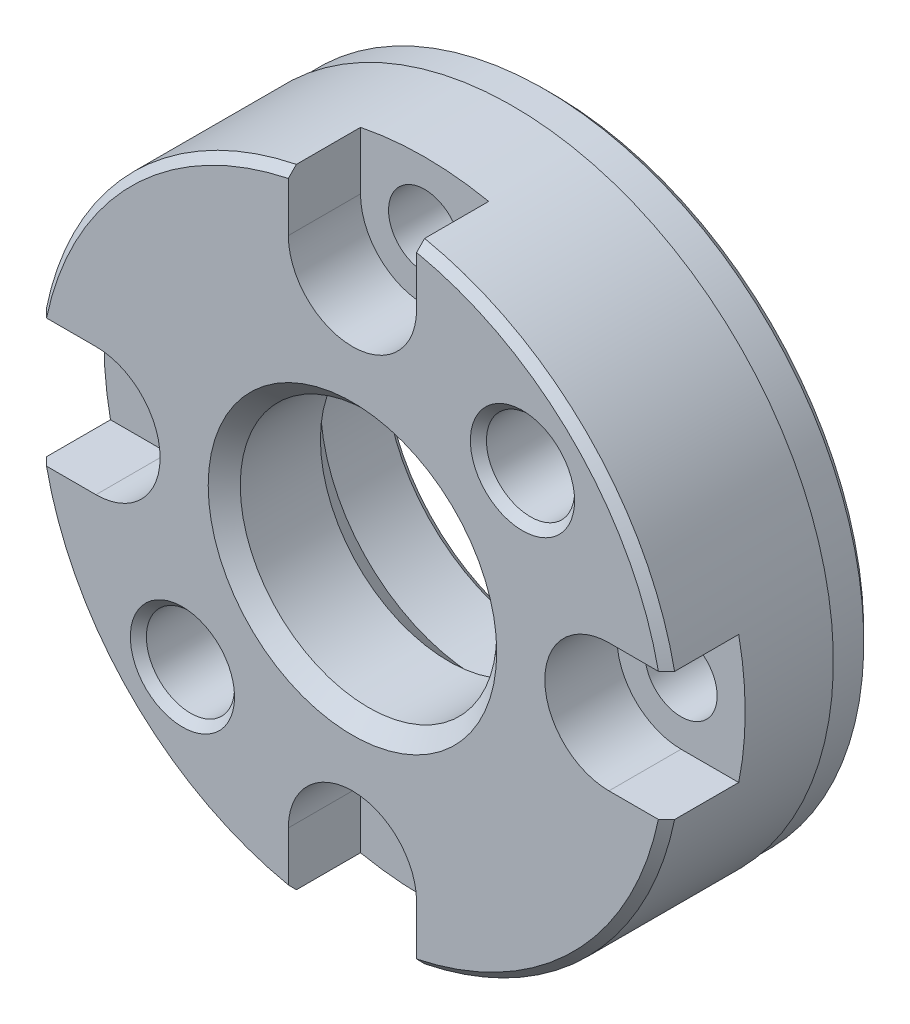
ISO-10303-21;
HEADER;
FILE_DESCRIPTION(('STEP AP214'),'2;1');
FILE_NAME('part.step','',(''),(''),'','','');
FILE_SCHEMA(('AUTOMOTIVE_DESIGN { 1 0 10303 214 1 1 1 1 }'));
ENDSEC;
DATA;
#1=APPLICATION_CONTEXT('core data for automotive mechanical design processes');
#2=APPLICATION_PROTOCOL_DEFINITION('international standard','automotive_design',2000,#1);
#3=PRODUCT_CONTEXT('',#1,'mechanical');
#4=PRODUCT('Part','Part','',(#3));
#5=PRODUCT_RELATED_PRODUCT_CATEGORY('part','',(#4));
#6=PRODUCT_DEFINITION_FORMATION('','',#4);
#7=PRODUCT_DEFINITION_CONTEXT('part definition',#1,'design');
#8=PRODUCT_DEFINITION('design','',#6,#7);
#9=PRODUCT_DEFINITION_SHAPE('','',#8);
#10=(LENGTH_UNIT() NAMED_UNIT(*) SI_UNIT(.MILLI.,.METRE.));
#11=(NAMED_UNIT(*) PLANE_ANGLE_UNIT() SI_UNIT($,.RADIAN.));
#12=(NAMED_UNIT(*) SI_UNIT($,.STERADIAN.) SOLID_ANGLE_UNIT());
#13=UNCERTAINTY_MEASURE_WITH_UNIT(LENGTH_MEASURE(1.E-05),#10,'distance_accuracy_value','');
#14=(GEOMETRIC_REPRESENTATION_CONTEXT(3) GLOBAL_UNCERTAINTY_ASSIGNED_CONTEXT((#13)) GLOBAL_UNIT_ASSIGNED_CONTEXT((#10,
#11,#12)) REPRESENTATION_CONTEXT('',''));
#15=CARTESIAN_POINT('',(0.,0.,0.));
#16=DIRECTION('',(0.,0.,1.));
#17=DIRECTION('',(1.,0.,0.));
#18=AXIS2_PLACEMENT_3D('',#15,#16,#17);
#19=CARTESIAN_POINT('',(-20.,0.,0.));
#20=DIRECTION('',(0.,0.,-1.));
#21=DIRECTION('',(-1.,0.,0.));
#22=AXIS2_PLACEMENT_3D('',#19,#20,#21);
#23=PLANE('',#22);
#24=CARTESIAN_POINT('',(10.6066017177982,10.6066017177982,0.));
#25=DIRECTION('',(0.,0.,1.));
#26=DIRECTION('',(1.,0.,0.));
#27=AXIS2_PLACEMENT_3D('',#24,#25,#26);
#28=CIRCLE('',#27,2.5);
#29=CARTESIAN_POINT('',(13.1066017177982,10.6066017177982,0.));
#30=VERTEX_POINT('',#29);
#31=EDGE_CURVE('E470',#30,#30,#28,.T.);
#32=ORIENTED_EDGE('',*,*,#31,.T.);
#33=EDGE_LOOP('',(#32));
#34=FACE_BOUND('',#33,.T.);
#35=CARTESIAN_POINT('',(-16.,0.,0.));
#36=DIRECTION('',(0.,0.,-1.));
#37=DIRECTION('',(-1.,0.,0.));
#38=AXIS2_PLACEMENT_3D('',#35,#36,#37);
#39=CIRCLE('',#38,2.75);
#40=CARTESIAN_POINT('',(-18.75,0.,0.));
#41=VERTEX_POINT('',#40);
#42=EDGE_CURVE('E277',#41,#41,#39,.F.);
#43=ORIENTED_EDGE('',*,*,#42,.T.);
#44=EDGE_LOOP('',(#43));
#45=FACE_BOUND('',#44,.T.);
#46=CARTESIAN_POINT('',(0.,-16.,0.));
#47=DIRECTION('',(0.,0.,-1.));
#48=DIRECTION('',(-1.,0.,0.));
#49=AXIS2_PLACEMENT_3D('',#46,#47,#48);
#50=CIRCLE('',#49,2.75);
#51=CARTESIAN_POINT('',(-2.74999999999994,-16.,0.));
#52=VERTEX_POINT('',#51);
#53=EDGE_CURVE('E290',#52,#52,#50,.F.);
#54=ORIENTED_EDGE('',*,*,#53,.T.);
#55=EDGE_LOOP('',(#54));
#56=FACE_BOUND('',#55,.T.);
#57=CARTESIAN_POINT('',(16.,1.13686837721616E-13,0.));
#58=DIRECTION('',(0.,0.,-1.));
#59=DIRECTION('',(-1.,0.,0.));
#60=AXIS2_PLACEMENT_3D('',#57,#58,#59);
#61=CIRCLE('',#60,2.75);
#62=CARTESIAN_POINT('',(13.25,1.13686837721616E-13,0.));
#63=VERTEX_POINT('',#62);
#64=EDGE_CURVE('E296',#63,#63,#61,.F.);
#65=ORIENTED_EDGE('',*,*,#64,.T.);
#66=EDGE_LOOP('',(#65));
#67=FACE_BOUND('',#66,.T.);
#68=CARTESIAN_POINT('',(-1.69550539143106E-13,16.,0.));
#69=DIRECTION('',(0.,0.,-1.));
#70=DIRECTION('',(-1.,0.,0.));
#71=AXIS2_PLACEMENT_3D('',#68,#69,#70);
#72=CIRCLE('',#71,2.75);
#73=CARTESIAN_POINT('',(-2.75000000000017,16.,0.));
#74=VERTEX_POINT('',#73);
#75=EDGE_CURVE('E302',#74,#74,#72,.F.);
#76=ORIENTED_EDGE('',*,*,#75,.T.);
#77=EDGE_LOOP('',(#76));
#78=FACE_BOUND('',#77,.T.);
#79=CARTESIAN_POINT('',(0.,0.,0.));
#80=DIRECTION('',(0.,0.,-1.));
#81=DIRECTION('',(-1.,0.,0.));
#82=AXIS2_PLACEMENT_3D('',#79,#80,#81);
#83=CIRCLE('',#82,19.4);
#84=CARTESIAN_POINT('',(-19.4,0.,0.));
#85=VERTEX_POINT('',#84);
#86=EDGE_CURVE('E358',#85,#85,#83,.T.);
#87=ORIENTED_EDGE('',*,*,#86,.T.);
#88=EDGE_LOOP('',(#87));
#89=FACE_BOUND('',#88,.T.);
#90=CARTESIAN_POINT('',(0.,0.,0.));
#91=DIRECTION('',(0.,0.,-1.));
#92=DIRECTION('',(-1.,0.,0.));
#93=AXIS2_PLACEMENT_3D('',#90,#91,#92);
#94=CIRCLE('',#93,10.5);
#95=CARTESIAN_POINT('',(-10.5,0.,0.));
#96=VERTEX_POINT('',#95);
#97=EDGE_CURVE('E458',#96,#96,#94,.F.);
#98=ORIENTED_EDGE('',*,*,#97,.T.);
#99=EDGE_LOOP('',(#98));
#100=FACE_BOUND('',#99,.T.);
#101=CARTESIAN_POINT('',(-10.6066017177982,-10.6066017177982,0.));
#102=DIRECTION('',(0.,0.,1.));
#103=DIRECTION('',(1.,0.,0.));
#104=AXIS2_PLACEMENT_3D('',#101,#102,#103);
#105=CIRCLE('',#104,2.5);
#106=CARTESIAN_POINT('',(-8.10660171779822,-10.6066017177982,0.));
#107=VERTEX_POINT('',#106);
#108=EDGE_CURVE('E461',#107,#107,#105,.T.);
#109=ORIENTED_EDGE('',*,*,#108,.T.);
#110=EDGE_LOOP('',(#109));
#111=FACE_BOUND('',#110,.T.);
#112=ADVANCED_FACE('F16',(#34,#45,#56,#67,#78,#89,#100,#111),#23,.T.);
#113=CARTESIAN_POINT('',(-20.,0.,12.5));
#114=DIRECTION('',(0.,0.,1.));
#115=DIRECTION('',(1.,0.,0.));
#116=AXIS2_PLACEMENT_3D('',#113,#114,#115);
#117=PLANE('',#116);
#118=CARTESIAN_POINT('',(-10.6066017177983,-10.6066017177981,12.5));
#119=DIRECTION('',(0.,0.,1.));
#120=DIRECTION('',(1.,0.,0.));
#121=AXIS2_PLACEMENT_3D('',#118,#119,#120);
#122=CIRCLE('',#121,3.25);
#123=CARTESIAN_POINT('',(-7.3566017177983,-10.6066017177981,12.5));
#124=VERTEX_POINT('',#123);
#125=EDGE_CURVE('E24',#124,#124,#122,.F.);
#126=ORIENTED_EDGE('',*,*,#125,.T.);
#127=EDGE_LOOP('',(#126));
#128=FACE_BOUND('',#127,.T.);
#129=CARTESIAN_POINT('',(10.6066017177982,10.6066017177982,12.5));
#130=DIRECTION('',(0.,0.,1.));
#131=DIRECTION('',(1.,0.,0.));
#132=AXIS2_PLACEMENT_3D('',#129,#130,#131);
#133=CIRCLE('',#132,3.25);
#134=CARTESIAN_POINT('',(13.8566017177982,10.6066017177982,12.5));
#135=VERTEX_POINT('',#134);
#136=EDGE_CURVE('E971',#135,#135,#133,.F.);
#137=ORIENTED_EDGE('',*,*,#136,.T.);
#138=EDGE_LOOP('',(#137));
#139=FACE_BOUND('',#138,.T.);
#140=CARTESIAN_POINT('',(0.,0.,12.5));
#141=DIRECTION('',(0.,0.,1.));
#142=DIRECTION('',(1.,0.,0.));
#143=AXIS2_PLACEMENT_3D('',#140,#141,#142);
#144=CIRCLE('',#143,9.);
#145=CARTESIAN_POINT('',(9.,0.,12.5));
#146=VERTEX_POINT('',#145);
#147=EDGE_CURVE('E984',#146,#146,#144,.F.);
#148=ORIENTED_EDGE('',*,*,#147,.T.);
#149=EDGE_LOOP('',(#148));
#150=FACE_BOUND('',#149,.T.);
#151=DIRECTION('',(1.,0.,0.));
#152=VECTOR('',#151,1.);
#153=CARTESIAN_POINT('',(-16.,-4.,12.5));
#154=LINE('',#153,#152);
#155=CARTESIAN_POINT('',(-19.0853346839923,-4.,12.5));
#156=VERTEX_POINT('',#155);
#157=CARTESIAN_POINT('',(-16.,-4.,12.5));
#158=VERTEX_POINT('',#157);
#159=EDGE_CURVE('E260',#156,#158,#154,.T.);
#160=ORIENTED_EDGE('',*,*,#159,.F.);
#161=CARTESIAN_POINT('',(0.,0.,12.5));
#162=DIRECTION('',(0.,0.,1.));
#163=DIRECTION('',(1.,0.,0.));
#164=AXIS2_PLACEMENT_3D('',#161,#162,#163);
#165=CIRCLE('',#164,19.5);
#166=CARTESIAN_POINT('',(-3.99999999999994,-19.0853346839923,12.5));
#167=VERTEX_POINT('',#166);
#168=EDGE_CURVE('E532',#156,#167,#165,.T.);
#169=ORIENTED_EDGE('',*,*,#168,.T.);
#170=DIRECTION('',(0.,-1.,0.));
#171=VECTOR('',#170,1.);
#172=CARTESIAN_POINT('',(-3.99999999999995,-16.,12.5));
#173=LINE('',#172,#171);
#174=CARTESIAN_POINT('',(-3.99999999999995,-16.,12.5));
#175=VERTEX_POINT('',#174);
#176=EDGE_CURVE('E238',#175,#167,#173,.T.);
#177=ORIENTED_EDGE('',*,*,#176,.F.);
#178=CARTESIAN_POINT('',(0.,-16.,12.5));
#179=DIRECTION('',(0.,0.,1.));
#180=DIRECTION('',(0.,1.,0.));
#181=AXIS2_PLACEMENT_3D('',#178,#179,#180);
#182=CIRCLE('',#181,4.);
#183=CARTESIAN_POINT('',(4.00000000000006,-16.,12.5));
#184=VERTEX_POINT('',#183);
#185=EDGE_CURVE('E217',#184,#175,#182,.T.);
#186=ORIENTED_EDGE('',*,*,#185,.F.);
#187=DIRECTION('',(0.,1.,0.));
#188=VECTOR('',#187,1.);
#189=CARTESIAN_POINT('',(4.00000000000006,-16.,12.5));
#190=LINE('',#189,#188);
#191=CARTESIAN_POINT('',(4.00000000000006,-19.0853346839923,12.5));
#192=VERTEX_POINT('',#191);
#193=EDGE_CURVE('E228',#192,#184,#190,.T.);
#194=ORIENTED_EDGE('',*,*,#193,.F.);
#195=CARTESIAN_POINT('',(0.,0.,12.5));
#196=DIRECTION('',(0.,0.,1.));
#197=DIRECTION('',(1.,0.,0.));
#198=AXIS2_PLACEMENT_3D('',#195,#196,#197);
#199=CIRCLE('',#198,19.5);
#200=CARTESIAN_POINT('',(19.0853346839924,-3.99999999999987,12.5));
#201=VERTEX_POINT('',#200);
#202=EDGE_CURVE('E526',#192,#201,#199,.T.);
#203=ORIENTED_EDGE('',*,*,#202,.T.);
#204=DIRECTION('',(1.,0.,0.));
#205=VECTOR('',#204,1.);
#206=CARTESIAN_POINT('',(16.,-3.99999999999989,12.5));
#207=LINE('',#206,#205);
#208=CARTESIAN_POINT('',(16.,-3.99999999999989,12.5));
#209=VERTEX_POINT('',#208);
#210=EDGE_CURVE('E210',#209,#201,#207,.T.);
#211=ORIENTED_EDGE('',*,*,#210,.F.);
#212=CARTESIAN_POINT('',(16.,1.13686837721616E-13,12.5));
#213=DIRECTION('',(0.,0.,1.));
#214=DIRECTION('',(-1.,0.,0.));
#215=AXIS2_PLACEMENT_3D('',#212,#213,#214);
#216=CIRCLE('',#215,4.);
#217=CARTESIAN_POINT('',(16.,4.00000000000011,12.5));
#218=VERTEX_POINT('',#217);
#219=EDGE_CURVE('E191',#218,#209,#216,.T.);
#220=ORIENTED_EDGE('',*,*,#219,.F.);
#221=DIRECTION('',(-1.,0.,0.));
#222=VECTOR('',#221,1.);
#223=CARTESIAN_POINT('',(16.,4.00000000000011,12.5));
#224=LINE('',#223,#222);
#225=CARTESIAN_POINT('',(19.0853346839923,4.00000000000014,12.5));
#226=VERTEX_POINT('',#225);
#227=EDGE_CURVE('E200',#226,#218,#224,.T.);
#228=ORIENTED_EDGE('',*,*,#227,.F.);
#229=CARTESIAN_POINT('',(0.,0.,12.5));
#230=DIRECTION('',(0.,0.,1.));
#231=DIRECTION('',(1.,0.,0.));
#232=AXIS2_PLACEMENT_3D('',#229,#230,#231);
#233=CIRCLE('',#232,19.5);
#234=CARTESIAN_POINT('',(3.9999999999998,19.0853346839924,12.5));
#235=VERTEX_POINT('',#234);
#236=EDGE_CURVE('E31',#226,#235,#233,.T.);
#237=ORIENTED_EDGE('',*,*,#236,.T.);
#238=DIRECTION('',(0.,1.,0.));
#239=VECTOR('',#238,1.);
#240=CARTESIAN_POINT('',(3.99999999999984,16.,12.5));
#241=LINE('',#240,#239);
#242=CARTESIAN_POINT('',(3.99999999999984,16.,12.5));
#243=VERTEX_POINT('',#242);
#244=EDGE_CURVE('E179',#243,#235,#241,.T.);
#245=ORIENTED_EDGE('',*,*,#244,.F.);
#246=CARTESIAN_POINT('',(-1.69550539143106E-13,16.,12.5));
#247=DIRECTION('',(0.,0.,1.));
#248=DIRECTION('',(0.,-1.,0.));
#249=AXIS2_PLACEMENT_3D('',#246,#247,#248);
#250=CIRCLE('',#249,4.);
#251=CARTESIAN_POINT('',(-4.00000000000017,16.,12.5));
#252=VERTEX_POINT('',#251);
#253=EDGE_CURVE('E162',#252,#243,#250,.T.);
#254=ORIENTED_EDGE('',*,*,#253,.F.);
#255=DIRECTION('',(0.,-1.,0.));
#256=VECTOR('',#255,1.);
#257=CARTESIAN_POINT('',(-4.00000000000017,16.,12.5));
#258=LINE('',#257,#256);
#259=CARTESIAN_POINT('',(-4.0000000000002,19.0853346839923,12.5));
#260=VERTEX_POINT('',#259);
#261=EDGE_CURVE('E177',#260,#252,#258,.T.);
#262=ORIENTED_EDGE('',*,*,#261,.F.);
#263=CARTESIAN_POINT('',(0.,0.,12.5));
#264=DIRECTION('',(0.,0.,1.));
#265=DIRECTION('',(1.,0.,0.));
#266=AXIS2_PLACEMENT_3D('',#263,#264,#265);
#267=CIRCLE('',#266,19.5);
#268=CARTESIAN_POINT('',(-19.0853346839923,4.,12.5));
#269=VERTEX_POINT('',#268);
#270=EDGE_CURVE('E328',#260,#269,#267,.T.);
#271=ORIENTED_EDGE('',*,*,#270,.T.);
#272=DIRECTION('',(-1.,0.,0.));
#273=VECTOR('',#272,1.);
#274=CARTESIAN_POINT('',(-16.,4.,12.5));
#275=LINE('',#274,#273);
#276=CARTESIAN_POINT('',(-16.,4.,12.5));
#277=VERTEX_POINT('',#276);
#278=EDGE_CURVE('E270',#277,#269,#275,.T.);
#279=ORIENTED_EDGE('',*,*,#278,.F.);
#280=CARTESIAN_POINT('',(-16.,0.,12.5));
#281=DIRECTION('',(0.,0.,1.));
#282=DIRECTION('',(1.,0.,0.));
#283=AXIS2_PLACEMENT_3D('',#280,#281,#282);
#284=CIRCLE('',#283,4.);
#285=EDGE_CURVE('E255',#158,#277,#284,.T.);
#286=ORIENTED_EDGE('',*,*,#285,.F.);
#287=EDGE_LOOP('',(#160,#169,#177,#186,#194,#203,#211,#220,#228,#237,#245,#254,#262,#271,#279,#286));
#288=FACE_BOUND('',#287,.T.);
#289=ADVANCED_FACE('F408',(#128,#139,#150,#288),#117,.T.);
#290=CARTESIAN_POINT('',(0.,0.,0.));
#291=DIRECTION('',(0.,0.,-1.));
#292=DIRECTION('',(-1.,0.,0.));
#293=AXIS2_PLACEMENT_3D('',#290,#291,#292);
#294=CYLINDRICAL_SURFACE('',#293,20.);
#295=CARTESIAN_POINT('',(0.,0.,2.5));
#296=DIRECTION('',(0.,0.,-1.));
#297=DIRECTION('',(-1.,0.,0.));
#298=AXIS2_PLACEMENT_3D('',#295,#296,#297);
#299=CIRCLE('',#298,20.);
#300=CARTESIAN_POINT('',(-20.,0.,2.5));
#301=VERTEX_POINT('',#300);
#302=EDGE_CURVE('E479',#301,#301,#299,.T.);
#303=ORIENTED_EDGE('',*,*,#302,.F.);
#304=EDGE_LOOP('',(#303));
#305=FACE_BOUND('',#304,.T.);
#306=DIRECTION('',(0.,0.,1.));
#307=VECTOR('',#306,1.);
#308=CARTESIAN_POINT('',(-3.99999999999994,-19.5959179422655,8.));
#309=LINE('',#308,#307);
#310=CARTESIAN_POINT('',(-3.99999999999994,-19.5959179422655,8.));
#311=VERTEX_POINT('',#310);
#312=CARTESIAN_POINT('',(-3.99999999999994,-19.5959179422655,12.));
#313=VERTEX_POINT('',#312);
#314=EDGE_CURVE('E249',#311,#313,#309,.T.);
#315=ORIENTED_EDGE('',*,*,#314,.T.);
#316=CARTESIAN_POINT('',(0.,0.,12.));
#317=DIRECTION('',(0.,0.,1.));
#318=DIRECTION('',(1.,0.,0.));
#319=AXIS2_PLACEMENT_3D('',#316,#317,#318);
#320=CIRCLE('',#319,20.);
#321=CARTESIAN_POINT('',(-19.5959179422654,-4.,12.));
#322=VERTEX_POINT('',#321);
#323=EDGE_CURVE('E317',#313,#322,#320,.F.);
#324=ORIENTED_EDGE('',*,*,#323,.T.);
#325=DIRECTION('',(0.,0.,1.));
#326=VECTOR('',#325,1.);
#327=CARTESIAN_POINT('',(-19.5959179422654,-4.,8.));
#328=LINE('',#327,#326);
#329=CARTESIAN_POINT('',(-19.5959179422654,-4.,8.));
#330=VERTEX_POINT('',#329);
#331=EDGE_CURVE('E278',#330,#322,#328,.T.);
#332=ORIENTED_EDGE('',*,*,#331,.F.);
#333=CARTESIAN_POINT('',(0.,0.,8.));
#334=DIRECTION('',(0.,0.,1.));
#335=DIRECTION('',(1.,0.,0.));
#336=AXIS2_PLACEMENT_3D('',#333,#334,#335);
#337=CIRCLE('',#336,20.);
#338=CARTESIAN_POINT('',(-19.5959179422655,4.,8.));
#339=VERTEX_POINT('',#338);
#340=EDGE_CURVE('E262',#339,#330,#337,.T.);
#341=ORIENTED_EDGE('',*,*,#340,.F.);
#342=DIRECTION('',(0.,0.,1.));
#343=VECTOR('',#342,1.);
#344=CARTESIAN_POINT('',(-19.5959179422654,4.,8.));
#345=LINE('',#344,#343);
#346=CARTESIAN_POINT('',(-19.5959179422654,4.,12.));
#347=VERTEX_POINT('',#346);
#348=EDGE_CURVE('E281',#339,#347,#345,.T.);
#349=ORIENTED_EDGE('',*,*,#348,.T.);
#350=CARTESIAN_POINT('',(0.,0.,12.));
#351=DIRECTION('',(0.,0.,1.));
#352=DIRECTION('',(1.,0.,0.));
#353=AXIS2_PLACEMENT_3D('',#350,#351,#352);
#354=CIRCLE('',#353,20.);
#355=CARTESIAN_POINT('',(-4.00000000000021,19.5959179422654,12.));
#356=VERTEX_POINT('',#355);
#357=EDGE_CURVE('E308',#347,#356,#354,.F.);
#358=ORIENTED_EDGE('',*,*,#357,.T.);
#359=DIRECTION('',(0.,0.,1.));
#360=VECTOR('',#359,1.);
#361=CARTESIAN_POINT('',(-4.00000000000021,19.5959179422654,8.));
#362=LINE('',#361,#360);
#363=CARTESIAN_POINT('',(-4.00000000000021,19.5959179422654,8.));
#364=VERTEX_POINT('',#363);
#365=EDGE_CURVE('E192',#364,#356,#362,.T.);
#366=ORIENTED_EDGE('',*,*,#365,.F.);
#367=CARTESIAN_POINT('',(0.,0.,8.));
#368=DIRECTION('',(0.,0.,1.));
#369=DIRECTION('',(0.,-1.,0.));
#370=AXIS2_PLACEMENT_3D('',#367,#368,#369);
#371=CIRCLE('',#370,20.);
#372=CARTESIAN_POINT('',(3.9999999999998,19.5959179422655,8.));
#373=VERTEX_POINT('',#372);
#374=EDGE_CURVE('E173',#373,#364,#371,.T.);
#375=ORIENTED_EDGE('',*,*,#374,.F.);
#376=DIRECTION('',(0.,0.,1.));
#377=VECTOR('',#376,1.);
#378=CARTESIAN_POINT('',(3.9999999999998,19.5959179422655,8.));
#379=LINE('',#378,#377);
#380=CARTESIAN_POINT('',(3.9999999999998,19.5959179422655,12.));
#381=VERTEX_POINT('',#380);
#382=EDGE_CURVE('E164',#373,#381,#379,.T.);
#383=ORIENTED_EDGE('',*,*,#382,.T.);
#384=CARTESIAN_POINT('',(0.,0.,12.));
#385=DIRECTION('',(0.,0.,1.));
#386=DIRECTION('',(1.,0.,0.));
#387=AXIS2_PLACEMENT_3D('',#384,#385,#386);
#388=CIRCLE('',#387,20.);
#389=CARTESIAN_POINT('',(19.5959179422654,4.00000000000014,12.));
#390=VERTEX_POINT('',#389);
#391=EDGE_CURVE('E311',#381,#390,#388,.F.);
#392=ORIENTED_EDGE('',*,*,#391,.T.);
#393=DIRECTION('',(0.,0.,1.));
#394=VECTOR('',#393,1.);
#395=CARTESIAN_POINT('',(19.5959179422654,4.00000000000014,8.));
#396=LINE('',#395,#394);
#397=CARTESIAN_POINT('',(19.5959179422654,4.00000000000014,8.));
#398=VERTEX_POINT('',#397);
#399=EDGE_CURVE('E218',#398,#390,#396,.T.);
#400=ORIENTED_EDGE('',*,*,#399,.F.);
#401=CARTESIAN_POINT('',(0.,0.,8.));
#402=DIRECTION('',(0.,0.,1.));
#403=DIRECTION('',(-1.,0.,0.));
#404=AXIS2_PLACEMENT_3D('',#401,#402,#403);
#405=CIRCLE('',#404,20.);
#406=CARTESIAN_POINT('',(19.5959179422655,-3.99999999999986,8.));
#407=VERTEX_POINT('',#406);
#408=EDGE_CURVE('E202',#407,#398,#405,.T.);
#409=ORIENTED_EDGE('',*,*,#408,.F.);
#410=DIRECTION('',(0.,0.,1.));
#411=VECTOR('',#410,1.);
#412=CARTESIAN_POINT('',(19.5959179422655,-3.99999999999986,8.));
#413=LINE('',#412,#411);
#414=CARTESIAN_POINT('',(19.5959179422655,-3.99999999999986,12.));
#415=VERTEX_POINT('',#414);
#416=EDGE_CURVE('E220',#407,#415,#413,.T.);
#417=ORIENTED_EDGE('',*,*,#416,.T.);
#418=CARTESIAN_POINT('',(0.,0.,12.));
#419=DIRECTION('',(0.,0.,1.));
#420=DIRECTION('',(1.,0.,0.));
#421=AXIS2_PLACEMENT_3D('',#418,#419,#420);
#422=CIRCLE('',#421,20.);
#423=CARTESIAN_POINT('',(4.00000000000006,-19.5959179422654,12.));
#424=VERTEX_POINT('',#423);
#425=EDGE_CURVE('E314',#415,#424,#422,.F.);
#426=ORIENTED_EDGE('',*,*,#425,.T.);
#427=DIRECTION('',(0.,0.,1.));
#428=VECTOR('',#427,1.);
#429=CARTESIAN_POINT('',(4.00000000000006,-19.5959179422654,8.));
#430=LINE('',#429,#428);
#431=CARTESIAN_POINT('',(4.00000000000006,-19.5959179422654,8.));
#432=VERTEX_POINT('',#431);
#433=EDGE_CURVE('E246',#432,#424,#430,.T.);
#434=ORIENTED_EDGE('',*,*,#433,.F.);
#435=CARTESIAN_POINT('',(0.,0.,8.));
#436=DIRECTION('',(0.,0.,1.));
#437=DIRECTION('',(0.,1.,0.));
#438=AXIS2_PLACEMENT_3D('',#435,#436,#437);
#439=CIRCLE('',#438,20.);
#440=EDGE_CURVE('E230',#311,#432,#439,.T.);
#441=ORIENTED_EDGE('',*,*,#440,.F.);
#442=EDGE_LOOP('',(#315,#324,#332,#341,#349,#358,#366,#375,#383,#392,#400,#409,#417,#426,#434,#441));
#443=FACE_BOUND('',#442,.T.);
#444=ADVANCED_FACE('F414',(#305,#443),#294,.T.);
#445=CARTESIAN_POINT('',(-16.,0.,8.));
#446=DIRECTION('',(0.,0.,1.));
#447=DIRECTION('',(1.,0.,0.));
#448=AXIS2_PLACEMENT_3D('',#445,#446,#447);
#449=CYLINDRICAL_SURFACE('',#448,4.);
#450=ORIENTED_EDGE('',*,*,#285,.T.);
#451=DIRECTION('',(0.,0.,1.));
#452=VECTOR('',#451,1.);
#453=CARTESIAN_POINT('',(-16.,4.,8.));
#454=LINE('',#453,#452);
#455=CARTESIAN_POINT('',(-16.,4.,8.));
#456=VERTEX_POINT('',#455);
#457=EDGE_CURVE('E267',#456,#277,#454,.T.);
#458=ORIENTED_EDGE('',*,*,#457,.F.);
#459=CARTESIAN_POINT('',(-16.,0.,8.));
#460=DIRECTION('',(0.,0.,1.));
#461=DIRECTION('',(1.,0.,0.));
#462=AXIS2_PLACEMENT_3D('',#459,#460,#461);
#463=CIRCLE('',#462,4.);
#464=CARTESIAN_POINT('',(-16.,-4.,8.));
#465=VERTEX_POINT('',#464);
#466=EDGE_CURVE('E256',#465,#456,#463,.T.);
#467=ORIENTED_EDGE('',*,*,#466,.F.);
#468=DIRECTION('',(0.,0.,1.));
#469=VECTOR('',#468,1.);
#470=CARTESIAN_POINT('',(-16.,-4.,8.));
#471=LINE('',#470,#469);
#472=EDGE_CURVE('E274',#465,#158,#471,.T.);
#473=ORIENTED_EDGE('',*,*,#472,.T.);
#474=EDGE_LOOP('',(#450,#458,#467,#473));
#475=FACE_BOUND('',#474,.T.);
#476=ADVANCED_FACE('F340',(#475),#449,.F.);
#477=CARTESIAN_POINT('',(-16.,-4.,8.));
#478=DIRECTION('',(0.,-1.,0.));
#479=DIRECTION('',(1.,0.,0.));
#480=AXIS2_PLACEMENT_3D('',#477,#478,#479);
#481=PLANE('',#480);
#482=ORIENTED_EDGE('',*,*,#331,.T.);
#483=CARTESIAN_POINT('',(-19.5959179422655,-4.,12.));
#484=CARTESIAN_POINT('',(-19.5108432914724,-4.,12.0833563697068));
#485=CARTESIAN_POINT('',(-19.4257573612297,-4.,12.1667012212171));
#486=CARTESIAN_POINT('',(-19.2555629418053,-4.,12.3333678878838));
#487=CARTESIAN_POINT('',(-19.1704544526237,-4.,12.4166897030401));
#488=CARTESIAN_POINT('',(-19.0853346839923,-4.,12.5));
#489=B_SPLINE_CURVE_WITH_KNOTS('',3,(#483,#484,#485,#486,#487,#488),.UNSPECIFIED.,.F.,.F.,(4,2,
4),(0.,0.357314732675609,0.71462946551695),.UNSPECIFIED.);
#490=EDGE_CURVE('E320',#322,#156,#489,.T.);
#491=ORIENTED_EDGE('',*,*,#490,.T.);
#492=ORIENTED_EDGE('',*,*,#159,.T.);
#493=ORIENTED_EDGE('',*,*,#472,.F.);
#494=DIRECTION('',(1.,0.,0.));
#495=VECTOR('',#494,1.);
#496=CARTESIAN_POINT('',(-16.,-4.,8.));
#497=LINE('',#496,#495);
#498=EDGE_CURVE('E264',#330,#465,#497,.T.);
#499=ORIENTED_EDGE('',*,*,#498,.F.);
#500=EDGE_LOOP('',(#482,#491,#492,#493,#499));
#501=FACE_BOUND('',#500,.T.);
#502=ADVANCED_FACE('F334',(#501),#481,.F.);
#503=CARTESIAN_POINT('',(-16.,4.,8.));
#504=DIRECTION('',(0.,1.,0.));
#505=DIRECTION('',(-1.,0.,0.));
#506=AXIS2_PLACEMENT_3D('',#503,#504,#505);
#507=PLANE('',#506);
#508=ORIENTED_EDGE('',*,*,#278,.T.);
#509=CARTESIAN_POINT('',(-19.0853346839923,4.,12.5));
#510=CARTESIAN_POINT('',(-19.1704544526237,4.,12.4166897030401));
#511=CARTESIAN_POINT('',(-19.2555629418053,4.,12.3333678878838));
#512=CARTESIAN_POINT('',(-19.4257573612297,4.,12.1667012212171));
#513=CARTESIAN_POINT('',(-19.5108432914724,4.,12.0833563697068));
#514=CARTESIAN_POINT('',(-19.5959179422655,4.,12.));
#515=B_SPLINE_CURVE_WITH_KNOTS('',3,(#509,#510,#511,#512,#513,#514),.UNSPECIFIED.,.F.,.F.,(4,2,
4),(0.,0.35731473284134,0.71462946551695),.UNSPECIFIED.);
#516=EDGE_CURVE('E350',#269,#347,#515,.T.);
#517=ORIENTED_EDGE('',*,*,#516,.T.);
#518=ORIENTED_EDGE('',*,*,#348,.F.);
#519=DIRECTION('',(-1.,0.,0.));
#520=VECTOR('',#519,1.);
#521=CARTESIAN_POINT('',(-16.,4.,8.));
#522=LINE('',#521,#520);
#523=EDGE_CURVE('E259',#456,#339,#522,.T.);
#524=ORIENTED_EDGE('',*,*,#523,.F.);
#525=ORIENTED_EDGE('',*,*,#457,.T.);
#526=EDGE_LOOP('',(#508,#517,#518,#524,#525));
#527=FACE_BOUND('',#526,.T.);
#528=ADVANCED_FACE('F339',(#527),#507,.F.);
#529=CARTESIAN_POINT('',(-16.,0.,8.));
#530=DIRECTION('',(0.,0.,1.));
#531=DIRECTION('',(1.,0.,0.));
#532=AXIS2_PLACEMENT_3D('',#529,#530,#531);
#533=PLANE('',#532);
#534=CARTESIAN_POINT('',(-16.,0.,8.));
#535=DIRECTION('',(0.,0.,1.));
#536=DIRECTION('',(1.,0.,0.));
#537=AXIS2_PLACEMENT_3D('',#534,#535,#536);
#538=CIRCLE('',#537,2.25);
#539=CARTESIAN_POINT('',(-13.75,0.,8.));
#540=VERTEX_POINT('',#539);
#541=EDGE_CURVE('E245',#540,#540,#538,.T.);
#542=ORIENTED_EDGE('',*,*,#541,.F.);
#543=EDGE_LOOP('',(#542));
#544=FACE_BOUND('',#543,.T.);
#545=ORIENTED_EDGE('',*,*,#466,.T.);
#546=ORIENTED_EDGE('',*,*,#523,.T.);
#547=ORIENTED_EDGE('',*,*,#340,.T.);
#548=ORIENTED_EDGE('',*,*,#498,.T.);
#549=EDGE_LOOP('',(#545,#546,#547,#548));
#550=FACE_BOUND('',#549,.T.);
#551=ADVANCED_FACE('F342',(#544,#550),#533,.T.);
#552=CARTESIAN_POINT('',(-16.,0.,0.));
#553=DIRECTION('',(0.,0.,1.));
#554=DIRECTION('',(1.,0.,0.));
#555=AXIS2_PLACEMENT_3D('',#552,#553,#554);
#556=CYLINDRICAL_SURFACE('',#555,2.25);
#557=CARTESIAN_POINT('',(-16.,0.,0.5));
#558=DIRECTION('',(0.,0.,-1.));
#559=DIRECTION('',(-1.,0.,0.));
#560=AXIS2_PLACEMENT_3D('',#557,#558,#559);
#561=CIRCLE('',#560,2.25);
#562=CARTESIAN_POINT('',(-18.25,0.,0.5));
#563=VERTEX_POINT('',#562);
#564=EDGE_CURVE('E287',#563,#563,#561,.T.);
#565=ORIENTED_EDGE('',*,*,#564,.T.);
#566=EDGE_LOOP('',(#565));
#567=FACE_BOUND('',#566,.T.);
#568=ORIENTED_EDGE('',*,*,#541,.T.);
#569=EDGE_LOOP('',(#568));
#570=FACE_BOUND('',#569,.T.);
#571=ADVANCED_FACE('F427',(#567,#570),#556,.F.);
#572=CARTESIAN_POINT('',(-16.,0.,0.));
#573=DIRECTION('',(0.,0.,-1.));
#574=DIRECTION('',(-1.,0.,0.));
#575=AXIS2_PLACEMENT_3D('',#572,#573,#574);
#576=CONICAL_SURFACE('',#575,2.75,0.785398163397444);
#577=ORIENTED_EDGE('',*,*,#564,.F.);
#578=EDGE_LOOP('',(#577));
#579=FACE_BOUND('',#578,.T.);
#580=ORIENTED_EDGE('',*,*,#42,.F.);
#581=EDGE_LOOP('',(#580));
#582=FACE_BOUND('',#581,.T.);
#583=ADVANCED_FACE('F423',(#579,#582),#576,.F.);
#584=CARTESIAN_POINT('',(0.,-16.,8.));
#585=DIRECTION('',(0.,0.,1.));
#586=DIRECTION('',(1.,0.,0.));
#587=AXIS2_PLACEMENT_3D('',#584,#585,#586);
#588=CYLINDRICAL_SURFACE('',#587,4.);
#589=ORIENTED_EDGE('',*,*,#185,.T.);
#590=DIRECTION('',(0.,0.,1.));
#591=VECTOR('',#590,1.);
#592=CARTESIAN_POINT('',(-3.99999999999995,-16.,8.));
#593=LINE('',#592,#591);
#594=CARTESIAN_POINT('',(-3.99999999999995,-16.,8.));
#595=VERTEX_POINT('',#594);
#596=EDGE_CURVE('E235',#595,#175,#593,.T.);
#597=ORIENTED_EDGE('',*,*,#596,.F.);
#598=CARTESIAN_POINT('',(0.,-16.,8.));
#599=DIRECTION('',(0.,0.,1.));
#600=DIRECTION('',(0.,1.,0.));
#601=AXIS2_PLACEMENT_3D('',#598,#599,#600);
#602=CIRCLE('',#601,4.);
#603=CARTESIAN_POINT('',(4.00000000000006,-16.,8.));
#604=VERTEX_POINT('',#603);
#605=EDGE_CURVE('E224',#604,#595,#602,.T.);
#606=ORIENTED_EDGE('',*,*,#605,.F.);
#607=DIRECTION('',(0.,0.,1.));
#608=VECTOR('',#607,1.);
#609=CARTESIAN_POINT('',(4.00000000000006,-16.,8.));
#610=LINE('',#609,#608);
#611=EDGE_CURVE('E242',#604,#184,#610,.T.);
#612=ORIENTED_EDGE('',*,*,#611,.T.);
#613=EDGE_LOOP('',(#589,#597,#606,#612));
#614=FACE_BOUND('',#613,.T.);
#615=ADVANCED_FACE('F426',(#614),#588,.F.);
#616=CARTESIAN_POINT('',(4.00000000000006,-16.,8.));
#617=DIRECTION('',(1.,0.,0.));
#618=DIRECTION('',(0.,1.,0.));
#619=AXIS2_PLACEMENT_3D('',#616,#617,#618);
#620=PLANE('',#619);
#621=ORIENTED_EDGE('',*,*,#433,.T.);
#622=CARTESIAN_POINT('',(4.00000000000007,-19.5959179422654,12.));
#623=CARTESIAN_POINT('',(4.00000000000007,-19.5108432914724,12.0833563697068));
#624=CARTESIAN_POINT('',(4.00000000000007,-19.4257573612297,12.1667012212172));
#625=CARTESIAN_POINT('',(4.00000000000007,-19.2555629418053,12.3333678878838));
#626=CARTESIAN_POINT('',(4.00000000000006,-19.1704544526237,12.4166897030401));
#627=CARTESIAN_POINT('',(4.00000000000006,-19.0853346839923,12.5));
#628=B_SPLINE_CURVE_WITH_KNOTS('',3,(#622,#623,#624,#625,#626,#627),.UNSPECIFIED.,.F.,.F.,(4,2,
4),(0.,0.357314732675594,0.714629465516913),.UNSPECIFIED.);
#629=EDGE_CURVE('E522',#424,#192,#628,.T.);
#630=ORIENTED_EDGE('',*,*,#629,.T.);
#631=ORIENTED_EDGE('',*,*,#193,.T.);
#632=ORIENTED_EDGE('',*,*,#611,.F.);
#633=DIRECTION('',(0.,1.,0.));
#634=VECTOR('',#633,1.);
#635=CARTESIAN_POINT('',(4.00000000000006,-16.,8.));
#636=LINE('',#635,#634);
#637=EDGE_CURVE('E232',#432,#604,#636,.T.);
#638=ORIENTED_EDGE('',*,*,#637,.F.);
#639=EDGE_LOOP('',(#621,#630,#631,#632,#638));
#640=FACE_BOUND('',#639,.T.);
#641=ADVANCED_FACE('F520',(#640),#620,.F.);
#642=CARTESIAN_POINT('',(-3.99999999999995,-16.,8.));
#643=DIRECTION('',(-1.,0.,0.));
#644=DIRECTION('',(0.,-1.,0.));
#645=AXIS2_PLACEMENT_3D('',#642,#643,#644);
#646=PLANE('',#645);
#647=ORIENTED_EDGE('',*,*,#176,.T.);
#648=CARTESIAN_POINT('',(-3.99999999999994,-19.0853346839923,12.5));
#649=CARTESIAN_POINT('',(-3.99999999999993,-19.1704544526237,12.4166897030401));
#650=CARTESIAN_POINT('',(-3.99999999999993,-19.2555629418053,12.3333678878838));
#651=CARTESIAN_POINT('',(-3.99999999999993,-19.4257573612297,12.1667012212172));
#652=CARTESIAN_POINT('',(-3.99999999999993,-19.5108432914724,12.0833563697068));
#653=CARTESIAN_POINT('',(-3.99999999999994,-19.5959179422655,12.));
#654=B_SPLINE_CURVE_WITH_KNOTS('',3,(#648,#649,#650,#651,#652,#653),.UNSPECIFIED.,.F.,.F.,(4,2,
4),(0.,0.35731473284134,0.71462946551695),.UNSPECIFIED.);
#655=EDGE_CURVE('E515',#167,#313,#654,.T.);
#656=ORIENTED_EDGE('',*,*,#655,.T.);
#657=ORIENTED_EDGE('',*,*,#314,.F.);
#658=DIRECTION('',(0.,-1.,0.));
#659=VECTOR('',#658,1.);
#660=CARTESIAN_POINT('',(-3.99999999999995,-16.,8.));
#661=LINE('',#660,#659);
#662=EDGE_CURVE('E227',#595,#311,#661,.T.);
#663=ORIENTED_EDGE('',*,*,#662,.F.);
#664=ORIENTED_EDGE('',*,*,#596,.T.);
#665=EDGE_LOOP('',(#647,#656,#657,#663,#664));
#666=FACE_BOUND('',#665,.T.);
#667=ADVANCED_FACE('F503',(#666),#646,.F.);
#668=CARTESIAN_POINT('',(0.,-16.,8.));
#669=DIRECTION('',(0.,0.,1.));
#670=DIRECTION('',(0.,1.,0.));
#671=AXIS2_PLACEMENT_3D('',#668,#669,#670);
#672=PLANE('',#671);
#673=CARTESIAN_POINT('',(0.,-16.,8.));
#674=DIRECTION('',(0.,0.,1.));
#675=DIRECTION('',(0.,1.,0.));
#676=AXIS2_PLACEMENT_3D('',#673,#674,#675);
#677=CIRCLE('',#676,2.25);
#678=CARTESIAN_POINT('',(0.,-13.75,8.));
#679=VERTEX_POINT('',#678);
#680=EDGE_CURVE('E182',#679,#679,#677,.T.);
#681=ORIENTED_EDGE('',*,*,#680,.F.);
#682=EDGE_LOOP('',(#681));
#683=FACE_BOUND('',#682,.T.);
#684=ORIENTED_EDGE('',*,*,#605,.T.);
#685=ORIENTED_EDGE('',*,*,#662,.T.);
#686=ORIENTED_EDGE('',*,*,#440,.T.);
#687=ORIENTED_EDGE('',*,*,#637,.T.);
#688=EDGE_LOOP('',(#684,#685,#686,#687));
#689=FACE_BOUND('',#688,.T.);
#690=ADVANCED_FACE('F499',(#683,#689),#672,.T.);
#691=CARTESIAN_POINT('',(16.,1.13686837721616E-13,8.));
#692=DIRECTION('',(0.,0.,1.));
#693=DIRECTION('',(1.,0.,0.));
#694=AXIS2_PLACEMENT_3D('',#691,#692,#693);
#695=CYLINDRICAL_SURFACE('',#694,4.);
#696=ORIENTED_EDGE('',*,*,#219,.T.);
#697=DIRECTION('',(0.,0.,1.));
#698=VECTOR('',#697,1.);
#699=CARTESIAN_POINT('',(16.,-3.99999999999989,8.));
#700=LINE('',#699,#698);
#701=CARTESIAN_POINT('',(16.,-3.99999999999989,8.));
#702=VERTEX_POINT('',#701);
#703=EDGE_CURVE('E207',#702,#209,#700,.T.);
#704=ORIENTED_EDGE('',*,*,#703,.F.);
#705=CARTESIAN_POINT('',(16.,1.13686837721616E-13,8.));
#706=DIRECTION('',(0.,0.,1.));
#707=DIRECTION('',(-1.,0.,0.));
#708=AXIS2_PLACEMENT_3D('',#705,#706,#707);
#709=CIRCLE('',#708,4.);
#710=CARTESIAN_POINT('',(16.,4.00000000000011,8.));
#711=VERTEX_POINT('',#710);
#712=EDGE_CURVE('E196',#711,#702,#709,.T.);
#713=ORIENTED_EDGE('',*,*,#712,.F.);
#714=DIRECTION('',(0.,0.,1.));
#715=VECTOR('',#714,1.);
#716=CARTESIAN_POINT('',(16.,4.00000000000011,8.));
#717=LINE('',#716,#715);
#718=EDGE_CURVE('E214',#711,#218,#717,.T.);
#719=ORIENTED_EDGE('',*,*,#718,.T.);
#720=EDGE_LOOP('',(#696,#704,#713,#719));
#721=FACE_BOUND('',#720,.T.);
#722=ADVANCED_FACE('F502',(#721),#695,.F.);
#723=CARTESIAN_POINT('',(16.,4.00000000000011,8.));
#724=DIRECTION('',(0.,1.,0.));
#725=DIRECTION('',(-1.,0.,0.));
#726=AXIS2_PLACEMENT_3D('',#723,#724,#725);
#727=PLANE('',#726);
#728=ORIENTED_EDGE('',*,*,#399,.T.);
#729=CARTESIAN_POINT('',(19.5959179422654,4.00000000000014,12.));
#730=CARTESIAN_POINT('',(19.5108432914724,4.00000000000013,12.0833563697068));
#731=CARTESIAN_POINT('',(19.4257573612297,4.00000000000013,12.1667012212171));
#732=CARTESIAN_POINT('',(19.2555629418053,4.00000000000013,12.3333678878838));
#733=CARTESIAN_POINT('',(19.1704544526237,4.00000000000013,12.4166897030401));
#734=CARTESIAN_POINT('',(19.0853346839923,4.00000000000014,12.5));
#735=B_SPLINE_CURVE_WITH_KNOTS('',3,(#729,#730,#731,#732,#733,#734),.UNSPECIFIED.,.F.,.F.,(4,2,
4),(0.,0.357314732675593,0.714629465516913),.UNSPECIFIED.);
#736=EDGE_CURVE('E39',#390,#226,#735,.T.);
#737=ORIENTED_EDGE('',*,*,#736,.T.);
#738=ORIENTED_EDGE('',*,*,#227,.T.);
#739=ORIENTED_EDGE('',*,*,#718,.F.);
#740=DIRECTION('',(-1.,0.,0.));
#741=VECTOR('',#740,1.);
#742=CARTESIAN_POINT('',(16.,4.00000000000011,8.));
#743=LINE('',#742,#741);
#744=EDGE_CURVE('E204',#398,#711,#743,.T.);
#745=ORIENTED_EDGE('',*,*,#744,.F.);
#746=EDGE_LOOP('',(#728,#737,#738,#739,#745));
#747=FACE_BOUND('',#746,.T.);
#748=ADVANCED_FACE('F605',(#747),#727,.F.);
#749=CARTESIAN_POINT('',(16.,-3.99999999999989,8.));
#750=DIRECTION('',(0.,-1.,0.));
#751=DIRECTION('',(1.,0.,0.));
#752=AXIS2_PLACEMENT_3D('',#749,#750,#751);
#753=PLANE('',#752);
#754=ORIENTED_EDGE('',*,*,#210,.T.);
#755=CARTESIAN_POINT('',(19.0853346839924,-3.99999999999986,12.5));
#756=CARTESIAN_POINT('',(19.1704544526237,-3.99999999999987,12.4166897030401));
#757=CARTESIAN_POINT('',(19.2555629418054,-3.99999999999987,12.3333678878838));
#758=CARTESIAN_POINT('',(19.4257573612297,-3.99999999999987,12.1667012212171));
#759=CARTESIAN_POINT('',(19.5108432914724,-3.99999999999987,12.0833563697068));
#760=CARTESIAN_POINT('',(19.5959179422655,-3.99999999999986,12.));
#761=B_SPLINE_CURVE_WITH_KNOTS('',3,(#755,#756,#757,#758,#759,#760),.UNSPECIFIED.,.F.,.F.,(4,2,
4),(0.,0.357314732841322,0.714629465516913),.UNSPECIFIED.);
#762=EDGE_CURVE('E531',#201,#415,#761,.T.);
#763=ORIENTED_EDGE('',*,*,#762,.T.);
#764=ORIENTED_EDGE('',*,*,#416,.F.);
#765=DIRECTION('',(1.,0.,0.));
#766=VECTOR('',#765,1.);
#767=CARTESIAN_POINT('',(16.,-3.99999999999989,8.));
#768=LINE('',#767,#766);
#769=EDGE_CURVE('E199',#702,#407,#768,.T.);
#770=ORIENTED_EDGE('',*,*,#769,.F.);
#771=ORIENTED_EDGE('',*,*,#703,.T.);
#772=EDGE_LOOP('',(#754,#763,#764,#770,#771));
#773=FACE_BOUND('',#772,.T.);
#774=ADVANCED_FACE('F600',(#773),#753,.F.);
#775=CARTESIAN_POINT('',(16.,1.13686837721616E-13,8.));
#776=DIRECTION('',(0.,0.,1.));
#777=DIRECTION('',(-1.,0.,0.));
#778=AXIS2_PLACEMENT_3D('',#775,#776,#777);
#779=PLANE('',#778);
#780=CARTESIAN_POINT('',(16.,1.13686837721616E-13,8.));
#781=DIRECTION('',(0.,0.,1.));
#782=DIRECTION('',(-1.,0.,0.));
#783=AXIS2_PLACEMENT_3D('',#780,#781,#782);
#784=CIRCLE('',#783,2.25);
#785=CARTESIAN_POINT('',(13.75,0.,8.));
#786=VERTEX_POINT('',#785);
#787=EDGE_CURVE('E490',#786,#786,#784,.T.);
#788=ORIENTED_EDGE('',*,*,#787,.F.);
#789=EDGE_LOOP('',(#788));
#790=FACE_BOUND('',#789,.T.);
#791=ORIENTED_EDGE('',*,*,#712,.T.);
#792=ORIENTED_EDGE('',*,*,#769,.T.);
#793=ORIENTED_EDGE('',*,*,#408,.T.);
#794=ORIENTED_EDGE('',*,*,#744,.T.);
#795=EDGE_LOOP('',(#791,#792,#793,#794));
#796=FACE_BOUND('',#795,.T.);
#797=ADVANCED_FACE('F604',(#790,#796),#779,.T.);
#798=CARTESIAN_POINT('',(-1.69550539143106E-13,16.,8.));
#799=DIRECTION('',(0.,0.,1.));
#800=DIRECTION('',(1.,0.,0.));
#801=AXIS2_PLACEMENT_3D('',#798,#799,#800);
#802=CYLINDRICAL_SURFACE('',#801,4.);
#803=ORIENTED_EDGE('',*,*,#253,.T.);
#804=DIRECTION('',(0.,0.,1.));
#805=VECTOR('',#804,1.);
#806=CARTESIAN_POINT('',(3.99999999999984,16.,8.));
#807=LINE('',#806,#805);
#808=CARTESIAN_POINT('',(3.99999999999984,16.,8.));
#809=VERTEX_POINT('',#808);
#810=EDGE_CURVE('E154',#809,#243,#807,.T.);
#811=ORIENTED_EDGE('',*,*,#810,.F.);
#812=CARTESIAN_POINT('',(-1.69550539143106E-13,16.,8.));
#813=DIRECTION('',(0.,0.,1.));
#814=DIRECTION('',(0.,-1.,0.));
#815=AXIS2_PLACEMENT_3D('',#812,#813,#814);
#816=CIRCLE('',#815,4.);
#817=CARTESIAN_POINT('',(-4.00000000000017,16.,8.));
#818=VERTEX_POINT('',#817);
#819=EDGE_CURVE('E159',#818,#809,#816,.T.);
#820=ORIENTED_EDGE('',*,*,#819,.F.);
#821=DIRECTION('',(0.,0.,1.));
#822=VECTOR('',#821,1.);
#823=CARTESIAN_POINT('',(-4.00000000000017,16.,8.));
#824=LINE('',#823,#822);
#825=EDGE_CURVE('E189',#818,#252,#824,.T.);
#826=ORIENTED_EDGE('',*,*,#825,.T.);
#827=EDGE_LOOP('',(#803,#811,#820,#826));
#828=FACE_BOUND('',#827,.T.);
#829=ADVANCED_FACE('F156',(#828),#802,.F.);
#830=CARTESIAN_POINT('',(-4.00000000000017,16.,8.));
#831=DIRECTION('',(-1.,0.,0.));
#832=DIRECTION('',(0.,-1.,0.));
#833=AXIS2_PLACEMENT_3D('',#830,#831,#832);
#834=PLANE('',#833);
#835=ORIENTED_EDGE('',*,*,#365,.T.);
#836=CARTESIAN_POINT('',(-4.00000000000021,19.5959179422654,12.));
#837=CARTESIAN_POINT('',(-4.00000000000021,19.5108432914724,12.0833563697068));
#838=CARTESIAN_POINT('',(-4.00000000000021,19.4257573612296,12.1667012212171));
#839=CARTESIAN_POINT('',(-4.00000000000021,19.2555629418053,12.3333678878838));
#840=CARTESIAN_POINT('',(-4.0000000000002,19.1704544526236,12.4166897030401));
#841=CARTESIAN_POINT('',(-4.0000000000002,19.0853346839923,12.5));
#842=B_SPLINE_CURVE_WITH_KNOTS('',3,(#836,#837,#838,#839,#840,#841),.UNSPECIFIED.,.F.,.F.,(4,2,
4),(0.,0.35731473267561,0.714629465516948),.UNSPECIFIED.);
#843=EDGE_CURVE('E359',#356,#260,#842,.T.);
#844=ORIENTED_EDGE('',*,*,#843,.T.);
#845=ORIENTED_EDGE('',*,*,#261,.T.);
#846=ORIENTED_EDGE('',*,*,#825,.F.);
#847=DIRECTION('',(0.,-1.,0.));
#848=VECTOR('',#847,1.);
#849=CARTESIAN_POINT('',(-4.00000000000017,16.,8.));
#850=LINE('',#849,#848);
#851=EDGE_CURVE('E165',#364,#818,#850,.T.);
#852=ORIENTED_EDGE('',*,*,#851,.F.);
#853=EDGE_LOOP('',(#835,#844,#845,#846,#852));
#854=FACE_BOUND('',#853,.T.);
#855=ADVANCED_FACE('F634',(#854),#834,.F.);
#856=CARTESIAN_POINT('',(3.99999999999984,16.,8.));
#857=DIRECTION('',(1.,0.,0.));
#858=DIRECTION('',(0.,1.,0.));
#859=AXIS2_PLACEMENT_3D('',#856,#857,#858);
#860=PLANE('',#859);
#861=ORIENTED_EDGE('',*,*,#244,.T.);
#862=CARTESIAN_POINT('',(3.9999999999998,19.0853346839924,12.5));
#863=CARTESIAN_POINT('',(3.9999999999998,19.1704544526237,12.4166897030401));
#864=CARTESIAN_POINT('',(3.9999999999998,19.2555629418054,12.3333678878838));
#865=CARTESIAN_POINT('',(3.9999999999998,19.4257573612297,12.1667012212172));
#866=CARTESIAN_POINT('',(3.9999999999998,19.5108432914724,12.0833563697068));
#867=CARTESIAN_POINT('',(3.9999999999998,19.5959179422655,12.));
#868=B_SPLINE_CURVE_WITH_KNOTS('',3,(#862,#863,#864,#865,#866,#867),.UNSPECIFIED.,.F.,.F.,(4,2,
4),(0.,0.357314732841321,0.714629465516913),.UNSPECIFIED.);
#869=EDGE_CURVE('E625',#235,#381,#868,.T.);
#870=ORIENTED_EDGE('',*,*,#869,.T.);
#871=ORIENTED_EDGE('',*,*,#382,.F.);
#872=DIRECTION('',(0.,1.,0.));
#873=VECTOR('',#872,1.);
#874=CARTESIAN_POINT('',(3.99999999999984,16.,8.));
#875=LINE('',#874,#873);
#876=EDGE_CURVE('E168',#809,#373,#875,.T.);
#877=ORIENTED_EDGE('',*,*,#876,.F.);
#878=ORIENTED_EDGE('',*,*,#810,.T.);
#879=EDGE_LOOP('',(#861,#870,#871,#877,#878));
#880=FACE_BOUND('',#879,.T.);
#881=ADVANCED_FACE('F169',(#880),#860,.F.);
#882=CARTESIAN_POINT('',(-1.69550539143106E-13,16.,8.));
#883=DIRECTION('',(0.,0.,1.));
#884=DIRECTION('',(0.,-1.,0.));
#885=AXIS2_PLACEMENT_3D('',#882,#883,#884);
#886=PLANE('',#885);
#887=CARTESIAN_POINT('',(-1.69550539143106E-13,16.,8.));
#888=DIRECTION('',(0.,0.,1.));
#889=DIRECTION('',(0.,-1.,0.));
#890=AXIS2_PLACEMENT_3D('',#887,#888,#889);
#891=CIRCLE('',#890,2.25);
#892=CARTESIAN_POINT('',(-1.45983040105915E-13,13.75,8.));
#893=VERTEX_POINT('',#892);
#894=EDGE_CURVE('E488',#893,#893,#891,.T.);
#895=ORIENTED_EDGE('',*,*,#894,.F.);
#896=EDGE_LOOP('',(#895));
#897=FACE_BOUND('',#896,.T.);
#898=ORIENTED_EDGE('',*,*,#819,.T.);
#899=ORIENTED_EDGE('',*,*,#876,.T.);
#900=ORIENTED_EDGE('',*,*,#374,.T.);
#901=ORIENTED_EDGE('',*,*,#851,.T.);
#902=EDGE_LOOP('',(#898,#899,#900,#901));
#903=FACE_BOUND('',#902,.T.);
#904=ADVANCED_FACE('F175',(#897,#903),#886,.T.);
#905=CARTESIAN_POINT('',(0.,-16.,0.));
#906=DIRECTION('',(0.,0.,1.));
#907=DIRECTION('',(1.,0.,0.));
#908=AXIS2_PLACEMENT_3D('',#905,#906,#907);
#909=CYLINDRICAL_SURFACE('',#908,2.25);
#910=CARTESIAN_POINT('',(0.,-16.,0.5));
#911=DIRECTION('',(0.,0.,-1.));
#912=DIRECTION('',(-1.,0.,0.));
#913=AXIS2_PLACEMENT_3D('',#910,#911,#912);
#914=CIRCLE('',#913,2.25);
#915=CARTESIAN_POINT('',(-2.24999999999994,-16.,0.5));
#916=VERTEX_POINT('',#915);
#917=EDGE_CURVE('E293',#916,#916,#914,.T.);
#918=ORIENTED_EDGE('',*,*,#917,.T.);
#919=EDGE_LOOP('',(#918));
#920=FACE_BOUND('',#919,.T.);
#921=ORIENTED_EDGE('',*,*,#680,.T.);
#922=EDGE_LOOP('',(#921));
#923=FACE_BOUND('',#922,.T.);
#924=ADVANCED_FACE('F497',(#920,#923),#909,.F.);
#925=CARTESIAN_POINT('',(16.,1.13686837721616E-13,0.));
#926=DIRECTION('',(0.,0.,1.));
#927=DIRECTION('',(1.,0.,0.));
#928=AXIS2_PLACEMENT_3D('',#925,#926,#927);
#929=CYLINDRICAL_SURFACE('',#928,2.25);
#930=CARTESIAN_POINT('',(16.,1.13686837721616E-13,0.5));
#931=DIRECTION('',(0.,0.,-1.));
#932=DIRECTION('',(-1.,0.,0.));
#933=AXIS2_PLACEMENT_3D('',#930,#931,#932);
#934=CIRCLE('',#933,2.25);
#935=CARTESIAN_POINT('',(13.75,1.13686837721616E-13,0.5));
#936=VERTEX_POINT('',#935);
#937=EDGE_CURVE('E299',#936,#936,#934,.T.);
#938=ORIENTED_EDGE('',*,*,#937,.T.);
#939=EDGE_LOOP('',(#938));
#940=FACE_BOUND('',#939,.T.);
#941=ORIENTED_EDGE('',*,*,#787,.T.);
#942=EDGE_LOOP('',(#941));
#943=FACE_BOUND('',#942,.T.);
#944=ADVANCED_FACE('F681',(#940,#943),#929,.F.);
#945=CARTESIAN_POINT('',(-1.69550539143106E-13,16.,0.));
#946=DIRECTION('',(0.,0.,1.));
#947=DIRECTION('',(1.,0.,0.));
#948=AXIS2_PLACEMENT_3D('',#945,#946,#947);
#949=CYLINDRICAL_SURFACE('',#948,2.25);
#950=CARTESIAN_POINT('',(-1.69550539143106E-13,16.,0.5));
#951=DIRECTION('',(0.,0.,-1.));
#952=DIRECTION('',(-1.,0.,0.));
#953=AXIS2_PLACEMENT_3D('',#950,#951,#952);
#954=CIRCLE('',#953,2.25);
#955=CARTESIAN_POINT('',(-2.25000000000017,16.,0.5));
#956=VERTEX_POINT('',#955);
#957=EDGE_CURVE('E305',#956,#956,#954,.T.);
#958=ORIENTED_EDGE('',*,*,#957,.T.);
#959=EDGE_LOOP('',(#958));
#960=FACE_BOUND('',#959,.T.);
#961=ORIENTED_EDGE('',*,*,#894,.T.);
#962=EDGE_LOOP('',(#961));
#963=FACE_BOUND('',#962,.T.);
#964=ADVANCED_FACE('F433',(#960,#963),#949,.F.);
#965=CARTESIAN_POINT('',(0.,-16.,0.));
#966=DIRECTION('',(0.,0.,-1.));
#967=DIRECTION('',(-1.,0.,0.));
#968=AXIS2_PLACEMENT_3D('',#965,#966,#967);
#969=CONICAL_SURFACE('',#968,2.75,0.785398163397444);
#970=ORIENTED_EDGE('',*,*,#917,.F.);
#971=EDGE_LOOP('',(#970));
#972=FACE_BOUND('',#971,.T.);
#973=ORIENTED_EDGE('',*,*,#53,.F.);
#974=EDGE_LOOP('',(#973));
#975=FACE_BOUND('',#974,.T.);
#976=ADVANCED_FACE('F429',(#972,#975),#969,.F.);
#977=CARTESIAN_POINT('',(16.,1.13686837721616E-13,0.));
#978=DIRECTION('',(0.,0.,-1.));
#979=DIRECTION('',(-1.,0.,0.));
#980=AXIS2_PLACEMENT_3D('',#977,#978,#979);
#981=CONICAL_SURFACE('',#980,2.75,0.785398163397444);
#982=ORIENTED_EDGE('',*,*,#937,.F.);
#983=EDGE_LOOP('',(#982));
#984=FACE_BOUND('',#983,.T.);
#985=ORIENTED_EDGE('',*,*,#64,.F.);
#986=EDGE_LOOP('',(#985));
#987=FACE_BOUND('',#986,.T.);
#988=ADVANCED_FACE('F432',(#984,#987),#981,.F.);
#989=CARTESIAN_POINT('',(-1.69550539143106E-13,16.,0.));
#990=DIRECTION('',(0.,0.,-1.));
#991=DIRECTION('',(-1.,0.,0.));
#992=AXIS2_PLACEMENT_3D('',#989,#990,#991);
#993=CONICAL_SURFACE('',#992,2.75,0.785398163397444);
#994=ORIENTED_EDGE('',*,*,#957,.F.);
#995=EDGE_LOOP('',(#994));
#996=FACE_BOUND('',#995,.T.);
#997=ORIENTED_EDGE('',*,*,#75,.F.);
#998=EDGE_LOOP('',(#997));
#999=FACE_BOUND('',#998,.T.);
#1000=ADVANCED_FACE('F436',(#996,#999),#993,.F.);
#1001=CARTESIAN_POINT('',(0.,0.,12.5));
#1002=DIRECTION('',(0.,0.,-1.));
#1003=DIRECTION('',(-1.,0.,0.));
#1004=AXIS2_PLACEMENT_3D('',#1001,#1002,#1003);
#1005=CYLINDRICAL_SURFACE('',#1004,8.);
#1006=CARTESIAN_POINT('',(0.,0.,11.5));
#1007=DIRECTION('',(0.,0.,1.));
#1008=DIRECTION('',(1.,0.,0.));
#1009=AXIS2_PLACEMENT_3D('',#1006,#1007,#1008);
#1010=CIRCLE('',#1009,8.);
#1011=CARTESIAN_POINT('',(8.,0.,11.5));
#1012=VERTEX_POINT('',#1011);
#1013=EDGE_CURVE('E986',#1012,#1012,#1010,.T.);
#1014=ORIENTED_EDGE('',*,*,#1013,.T.);
#1015=EDGE_LOOP('',(#1014));
#1016=FACE_BOUND('',#1015,.T.);
#1017=CARTESIAN_POINT('',(0.,0.,6.5));
#1018=DIRECTION('',(0.,0.,-1.));
#1019=DIRECTION('',(-1.,0.,0.));
#1020=AXIS2_PLACEMENT_3D('',#1017,#1018,#1019);
#1021=CIRCLE('',#1020,8.);
#1022=CARTESIAN_POINT('',(-8.,0.,6.5));
#1023=VERTEX_POINT('',#1022);
#1024=EDGE_CURVE('E482',#1023,#1023,#1021,.T.);
#1025=ORIENTED_EDGE('',*,*,#1024,.T.);
#1026=EDGE_LOOP('',(#1025));
#1027=FACE_BOUND('',#1026,.T.);
#1028=ADVANCED_FACE('F439',(#1016,#1027),#1005,.F.);
#1029=CARTESIAN_POINT('',(0.,0.,12.));
#1030=DIRECTION('',(0.,0.,-1.));
#1031=DIRECTION('',(-1.,0.,0.));
#1032=AXIS2_PLACEMENT_3D('',#1029,#1030,#1031);
#1033=CONICAL_SURFACE('',#1032,20.,0.785398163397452);
#1034=ORIENTED_EDGE('',*,*,#655,.F.);
#1035=ORIENTED_EDGE('',*,*,#168,.F.);
#1036=ORIENTED_EDGE('',*,*,#490,.F.);
#1037=ORIENTED_EDGE('',*,*,#323,.F.);
#1038=EDGE_LOOP('',(#1034,#1035,#1036,#1037));
#1039=FACE_BOUND('',#1038,.T.);
#1040=ADVANCED_FACE('F330',(#1039),#1033,.T.);
#1041=CARTESIAN_POINT('',(0.,0.,12.));
#1042=DIRECTION('',(0.,0.,-1.));
#1043=DIRECTION('',(-1.,0.,0.));
#1044=AXIS2_PLACEMENT_3D('',#1041,#1042,#1043);
#1045=CONICAL_SURFACE('',#1044,20.,0.785398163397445);
#1046=ORIENTED_EDGE('',*,*,#762,.F.);
#1047=ORIENTED_EDGE('',*,*,#202,.F.);
#1048=ORIENTED_EDGE('',*,*,#629,.F.);
#1049=ORIENTED_EDGE('',*,*,#425,.F.);
#1050=EDGE_LOOP('',(#1046,#1047,#1048,#1049));
#1051=FACE_BOUND('',#1050,.T.);
#1052=ADVANCED_FACE('F529',(#1051),#1045,.T.);
#1053=CARTESIAN_POINT('',(0.,0.,12.));
#1054=DIRECTION('',(0.,0.,-1.));
#1055=DIRECTION('',(-1.,0.,0.));
#1056=AXIS2_PLACEMENT_3D('',#1053,#1054,#1055);
#1057=CONICAL_SURFACE('',#1056,20.,0.785398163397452);
#1058=ORIENTED_EDGE('',*,*,#869,.F.);
#1059=ORIENTED_EDGE('',*,*,#236,.F.);
#1060=ORIENTED_EDGE('',*,*,#736,.F.);
#1061=ORIENTED_EDGE('',*,*,#391,.F.);
#1062=EDGE_LOOP('',(#1058,#1059,#1060,#1061));
#1063=FACE_BOUND('',#1062,.T.);
#1064=ADVANCED_FACE('F373',(#1063),#1057,.T.);
#1065=CARTESIAN_POINT('',(0.,0.,12.));
#1066=DIRECTION('',(0.,0.,-1.));
#1067=DIRECTION('',(-1.,0.,0.));
#1068=AXIS2_PLACEMENT_3D('',#1065,#1066,#1067);
#1069=CONICAL_SURFACE('',#1068,20.,0.785398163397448);
#1070=ORIENTED_EDGE('',*,*,#516,.F.);
#1071=ORIENTED_EDGE('',*,*,#270,.F.);
#1072=ORIENTED_EDGE('',*,*,#843,.F.);
#1073=ORIENTED_EDGE('',*,*,#357,.F.);
#1074=EDGE_LOOP('',(#1070,#1071,#1072,#1073));
#1075=FACE_BOUND('',#1074,.T.);
#1076=ADVANCED_FACE('F367',(#1075),#1069,.T.);
#1077=CARTESIAN_POINT('',(0.,0.,0.));
#1078=DIRECTION('',(0.,0.,-1.));
#1079=DIRECTION('',(-1.,0.,0.));
#1080=AXIS2_PLACEMENT_3D('',#1077,#1078,#1079);
#1081=CYLINDRICAL_SURFACE('',#1080,10.);
#1082=CARTESIAN_POINT('',(0.,0.,0.500000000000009));
#1083=DIRECTION('',(0.,0.,-1.));
#1084=DIRECTION('',(-1.,0.,0.));
#1085=AXIS2_PLACEMENT_3D('',#1082,#1083,#1084);
#1086=CIRCLE('',#1085,10.);
#1087=CARTESIAN_POINT('',(-10.,0.,0.500000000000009));
#1088=VERTEX_POINT('',#1087);
#1089=EDGE_CURVE('E975',#1088,#1088,#1086,.T.);
#1090=ORIENTED_EDGE('',*,*,#1089,.T.);
#1091=EDGE_LOOP('',(#1090));
#1092=FACE_BOUND('',#1091,.T.);
#1093=CARTESIAN_POINT('',(0.,0.,4.5));
#1094=DIRECTION('',(0.,0.,-1.));
#1095=DIRECTION('',(-1.,0.,0.));
#1096=AXIS2_PLACEMENT_3D('',#1093,#1094,#1095);
#1097=CIRCLE('',#1096,10.);
#1098=CARTESIAN_POINT('',(-10.,0.,4.5));
#1099=VERTEX_POINT('',#1098);
#1100=EDGE_CURVE('E485',#1099,#1099,#1097,.T.);
#1101=ORIENTED_EDGE('',*,*,#1100,.F.);
#1102=EDGE_LOOP('',(#1101));
#1103=FACE_BOUND('',#1102,.T.);
#1104=ADVANCED_FACE('F372',(#1092,#1103),#1081,.F.);
#1105=CARTESIAN_POINT('',(0.,0.,4.5));
#1106=DIRECTION('',(0.,0.,-1.));
#1107=DIRECTION('',(-1.,0.,0.));
#1108=AXIS2_PLACEMENT_3D('',#1105,#1106,#1107);
#1109=CONICAL_SURFACE('',#1108,10.,0.785398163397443);
#1110=ORIENTED_EDGE('',*,*,#1024,.F.);
#1111=EDGE_LOOP('',(#1110));
#1112=FACE_BOUND('',#1111,.T.);
#1113=ORIENTED_EDGE('',*,*,#1100,.T.);
#1114=EDGE_LOOP('',(#1113));
#1115=FACE_BOUND('',#1114,.T.);
#1116=ADVANCED_FACE('F802',(#1112,#1115),#1109,.F.);
#1117=CARTESIAN_POINT('',(-20.,0.,2.5));
#1118=DIRECTION('',(0.,0.,1.));
#1119=DIRECTION('',(1.,0.,0.));
#1120=AXIS2_PLACEMENT_3D('',#1117,#1118,#1119);
#1121=PLANE('',#1120);
#1122=CARTESIAN_POINT('',(0.,0.,2.5));
#1123=DIRECTION('',(0.,0.,-1.));
#1124=DIRECTION('',(-1.,0.,0.));
#1125=AXIS2_PLACEMENT_3D('',#1122,#1123,#1124);
#1126=CIRCLE('',#1125,19.9);
#1127=CARTESIAN_POINT('',(-19.9,0.,2.5));
#1128=VERTEX_POINT('',#1127);
#1129=EDGE_CURVE('E476',#1128,#1128,#1126,.T.);
#1130=ORIENTED_EDGE('',*,*,#1129,.F.);
#1131=EDGE_LOOP('',(#1130));
#1132=FACE_BOUND('',#1131,.T.);
#1133=ORIENTED_EDGE('',*,*,#302,.T.);
#1134=EDGE_LOOP('',(#1133));
#1135=FACE_BOUND('',#1134,.T.);
#1136=ADVANCED_FACE('F811',(#1132,#1135),#1121,.F.);
#1137=CARTESIAN_POINT('',(0.,0.,0.));
#1138=DIRECTION('',(0.,0.,-1.));
#1139=DIRECTION('',(-1.,0.,0.));
#1140=AXIS2_PLACEMENT_3D('',#1137,#1138,#1139);
#1141=CYLINDRICAL_SURFACE('',#1140,19.9);
#1142=CARTESIAN_POINT('',(0.,0.,0.500000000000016));
#1143=DIRECTION('',(0.,0.,-1.));
#1144=DIRECTION('',(-1.,0.,0.));
#1145=AXIS2_PLACEMENT_3D('',#1142,#1143,#1144);
#1146=CIRCLE('',#1145,19.9);
#1147=CARTESIAN_POINT('',(-19.9,0.,0.500000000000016));
#1148=VERTEX_POINT('',#1147);
#1149=EDGE_CURVE('E987',#1148,#1148,#1146,.F.);
#1150=ORIENTED_EDGE('',*,*,#1149,.T.);
#1151=EDGE_LOOP('',(#1150));
#1152=FACE_BOUND('',#1151,.T.);
#1153=ORIENTED_EDGE('',*,*,#1129,.T.);
#1154=EDGE_LOOP('',(#1153));
#1155=FACE_BOUND('',#1154,.T.);
#1156=ADVANCED_FACE('F381',(#1152,#1155),#1141,.T.);
#1157=CARTESIAN_POINT('',(0.,0.,0.));
#1158=DIRECTION('',(0.,0.,1.));
#1159=DIRECTION('',(1.,0.,0.));
#1160=AXIS2_PLACEMENT_3D('',#1157,#1158,#1159);
#1161=CONICAL_SURFACE('',#1160,19.4,0.785398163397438);
#1162=ORIENTED_EDGE('',*,*,#1149,.F.);
#1163=EDGE_LOOP('',(#1162));
#1164=FACE_BOUND('',#1163,.T.);
#1165=ORIENTED_EDGE('',*,*,#86,.F.);
#1166=EDGE_LOOP('',(#1165));
#1167=FACE_BOUND('',#1166,.T.);
#1168=ADVANCED_FACE('F376',(#1164,#1167),#1161,.T.);
#1169=CARTESIAN_POINT('',(0.,0.,12.5));
#1170=DIRECTION('',(0.,0.,1.));
#1171=DIRECTION('',(1.,0.,0.));
#1172=AXIS2_PLACEMENT_3D('',#1169,#1170,#1171);
#1173=CONICAL_SURFACE('',#1172,9.,0.785398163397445);
#1174=ORIENTED_EDGE('',*,*,#1013,.F.);
#1175=EDGE_LOOP('',(#1174));
#1176=FACE_BOUND('',#1175,.T.);
#1177=ORIENTED_EDGE('',*,*,#147,.F.);
#1178=EDGE_LOOP('',(#1177));
#1179=FACE_BOUND('',#1178,.T.);
#1180=ADVANCED_FACE('F380',(#1176,#1179),#1173,.F.);
#1181=CARTESIAN_POINT('',(0.,0.,0.500000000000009));
#1182=DIRECTION('',(0.,0.,-1.));
#1183=DIRECTION('',(-1.,0.,0.));
#1184=AXIS2_PLACEMENT_3D('',#1181,#1182,#1183);
#1185=CONICAL_SURFACE('',#1184,10.,0.785398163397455);
#1186=ORIENTED_EDGE('',*,*,#97,.F.);
#1187=EDGE_LOOP('',(#1186));
#1188=FACE_BOUND('',#1187,.T.);
#1189=ORIENTED_EDGE('',*,*,#1089,.F.);
#1190=EDGE_LOOP('',(#1189));
#1191=FACE_BOUND('',#1190,.T.);
#1192=ADVANCED_FACE('F385',(#1188,#1191),#1185,.F.);
#1193=CARTESIAN_POINT('',(10.6066017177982,10.6066017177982,7.5));
#1194=DIRECTION('',(0.,0.,1.));
#1195=DIRECTION('',(1.,0.,0.));
#1196=AXIS2_PLACEMENT_3D('',#1193,#1194,#1195);
#1197=CYLINDRICAL_SURFACE('',#1196,2.75);
#1198=CARTESIAN_POINT('',(10.6066017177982,10.6066017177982,12.));
#1199=DIRECTION('',(0.,0.,1.));
#1200=DIRECTION('',(1.,0.,0.));
#1201=AXIS2_PLACEMENT_3D('',#1198,#1199,#1200);
#1202=CIRCLE('',#1201,2.75);
#1203=CARTESIAN_POINT('',(13.3566017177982,10.6066017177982,12.));
#1204=VERTEX_POINT('',#1203);
#1205=EDGE_CURVE('E10',#1204,#1204,#1202,.T.);
#1206=ORIENTED_EDGE('',*,*,#1205,.T.);
#1207=EDGE_LOOP('',(#1206));
#1208=FACE_BOUND('',#1207,.T.);
#1209=CARTESIAN_POINT('',(10.6066017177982,10.6066017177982,7.5));
#1210=DIRECTION('',(0.,0.,1.));
#1211=DIRECTION('',(1.,0.,0.));
#1212=AXIS2_PLACEMENT_3D('',#1209,#1210,#1211);
#1213=CIRCLE('',#1212,2.75);
#1214=CARTESIAN_POINT('',(13.3566017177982,10.6066017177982,7.5));
#1215=VERTEX_POINT('',#1214);
#1216=EDGE_CURVE('E467',#1215,#1215,#1213,.T.);
#1217=ORIENTED_EDGE('',*,*,#1216,.F.);
#1218=EDGE_LOOP('',(#1217));
#1219=FACE_BOUND('',#1218,.T.);
#1220=ADVANCED_FACE('F388',(#1208,#1219),#1197,.F.);
#1221=CARTESIAN_POINT('',(10.6066017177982,10.6066017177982,7.5));
#1222=DIRECTION('',(0.,0.,1.));
#1223=DIRECTION('',(1.,0.,0.));
#1224=AXIS2_PLACEMENT_3D('',#1221,#1222,#1223);
#1225=PLANE('',#1224);
#1226=CARTESIAN_POINT('',(10.6066017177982,10.6066017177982,7.5));
#1227=DIRECTION('',(0.,0.,1.));
#1228=DIRECTION('',(1.,0.,0.));
#1229=AXIS2_PLACEMENT_3D('',#1226,#1227,#1228);
#1230=CIRCLE('',#1229,2.5);
#1231=CARTESIAN_POINT('',(13.1066017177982,10.6066017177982,7.5));
#1232=VERTEX_POINT('',#1231);
#1233=EDGE_CURVE('E947',#1232,#1232,#1230,.T.);
#1234=ORIENTED_EDGE('',*,*,#1233,.F.);
#1235=EDGE_LOOP('',(#1234));
#1236=FACE_BOUND('',#1235,.T.);
#1237=ORIENTED_EDGE('',*,*,#1216,.T.);
#1238=EDGE_LOOP('',(#1237));
#1239=FACE_BOUND('',#1238,.T.);
#1240=ADVANCED_FACE('F851',(#1236,#1239),#1225,.T.);
#1241=CARTESIAN_POINT('',(-10.6066017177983,-10.6066017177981,7.5));
#1242=DIRECTION('',(0.,0.,1.));
#1243=DIRECTION('',(1.,0.,0.));
#1244=AXIS2_PLACEMENT_3D('',#1241,#1242,#1243);
#1245=CYLINDRICAL_SURFACE('',#1244,2.75);
#1246=CARTESIAN_POINT('',(-10.6066017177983,-10.6066017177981,12.));
#1247=DIRECTION('',(0.,0.,1.));
#1248=DIRECTION('',(1.,0.,0.));
#1249=AXIS2_PLACEMENT_3D('',#1246,#1247,#1248);
#1250=CIRCLE('',#1249,2.75);
#1251=CARTESIAN_POINT('',(-7.8566017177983,-10.6066017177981,12.));
#1252=VERTEX_POINT('',#1251);
#1253=EDGE_CURVE('E970',#1252,#1252,#1250,.T.);
#1254=ORIENTED_EDGE('',*,*,#1253,.T.);
#1255=EDGE_LOOP('',(#1254));
#1256=FACE_BOUND('',#1255,.T.);
#1257=CARTESIAN_POINT('',(-10.6066017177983,-10.6066017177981,7.5));
#1258=DIRECTION('',(0.,0.,1.));
#1259=DIRECTION('',(1.,0.,0.));
#1260=AXIS2_PLACEMENT_3D('',#1257,#1258,#1259);
#1261=CIRCLE('',#1260,2.75);
#1262=CARTESIAN_POINT('',(-7.8566017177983,-10.6066017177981,7.5));
#1263=VERTEX_POINT('',#1262);
#1264=EDGE_CURVE('E463',#1263,#1263,#1261,.T.);
#1265=ORIENTED_EDGE('',*,*,#1264,.F.);
#1266=EDGE_LOOP('',(#1265));
#1267=FACE_BOUND('',#1266,.T.);
#1268=ADVANCED_FACE('F402',(#1256,#1267),#1245,.F.);
#1269=CARTESIAN_POINT('',(-10.6066017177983,-10.6066017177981,7.5));
#1270=DIRECTION('',(0.,0.,1.));
#1271=DIRECTION('',(1.,0.,0.));
#1272=AXIS2_PLACEMENT_3D('',#1269,#1270,#1271);
#1273=PLANE('',#1272);
#1274=CARTESIAN_POINT('',(-10.6066017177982,-10.6066017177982,7.5));
#1275=DIRECTION('',(0.,0.,1.));
#1276=DIRECTION('',(1.,0.,0.));
#1277=AXIS2_PLACEMENT_3D('',#1274,#1275,#1276);
#1278=CIRCLE('',#1277,2.5);
#1279=CARTESIAN_POINT('',(-8.10660171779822,-10.6066017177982,7.5));
#1280=VERTEX_POINT('',#1279);
#1281=EDGE_CURVE('E464',#1280,#1280,#1278,.T.);
#1282=ORIENTED_EDGE('',*,*,#1281,.F.);
#1283=EDGE_LOOP('',(#1282));
#1284=FACE_BOUND('',#1283,.T.);
#1285=ORIENTED_EDGE('',*,*,#1264,.T.);
#1286=EDGE_LOOP('',(#1285));
#1287=FACE_BOUND('',#1286,.T.);
#1288=ADVANCED_FACE('F392',(#1284,#1287),#1273,.T.);
#1289=CARTESIAN_POINT('',(-10.6066017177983,-10.6066017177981,12.));
#1290=DIRECTION('',(0.,0.,1.));
#1291=DIRECTION('',(1.,0.,0.));
#1292=AXIS2_PLACEMENT_3D('',#1289,#1290,#1291);
#1293=CONICAL_SURFACE('',#1292,2.75,0.785398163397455);
#1294=ORIENTED_EDGE('',*,*,#125,.F.);
#1295=EDGE_LOOP('',(#1294));
#1296=FACE_BOUND('',#1295,.T.);
#1297=ORIENTED_EDGE('',*,*,#1253,.F.);
#1298=EDGE_LOOP('',(#1297));
#1299=FACE_BOUND('',#1298,.T.);
#1300=ADVANCED_FACE('F390',(#1296,#1299),#1293,.F.);
#1301=CARTESIAN_POINT('',(10.6066017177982,10.6066017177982,12.));
#1302=DIRECTION('',(0.,0.,1.));
#1303=DIRECTION('',(1.,0.,0.));
#1304=AXIS2_PLACEMENT_3D('',#1301,#1302,#1303);
#1305=CONICAL_SURFACE('',#1304,2.75,0.785398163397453);
#1306=ORIENTED_EDGE('',*,*,#136,.F.);
#1307=EDGE_LOOP('',(#1306));
#1308=FACE_BOUND('',#1307,.T.);
#1309=ORIENTED_EDGE('',*,*,#1205,.F.);
#1310=EDGE_LOOP('',(#1309));
#1311=FACE_BOUND('',#1310,.T.);
#1312=ADVANCED_FACE('F18',(#1308,#1311),#1305,.F.);
#1313=CARTESIAN_POINT('',(-10.6066017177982,-10.6066017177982,7.5));
#1314=DIRECTION('',(0.,0.,1.));
#1315=DIRECTION('',(1.,0.,0.));
#1316=AXIS2_PLACEMENT_3D('',#1313,#1314,#1315);
#1317=CYLINDRICAL_SURFACE('',#1316,2.5);
#1318=ORIENTED_EDGE('',*,*,#108,.F.);
#1319=EDGE_LOOP('',(#1318));
#1320=FACE_BOUND('',#1319,.T.);
#1321=ORIENTED_EDGE('',*,*,#1281,.T.);
#1322=EDGE_LOOP('',(#1321));
#1323=FACE_BOUND('',#1322,.T.);
#1324=ADVANCED_FACE('F400',(#1320,#1323),#1317,.F.);
#1325=CARTESIAN_POINT('',(10.6066017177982,10.6066017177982,7.5));
#1326=DIRECTION('',(0.,0.,1.));
#1327=DIRECTION('',(1.,0.,0.));
#1328=AXIS2_PLACEMENT_3D('',#1325,#1326,#1327);
#1329=CYLINDRICAL_SURFACE('',#1328,2.5);
#1330=ORIENTED_EDGE('',*,*,#31,.F.);
#1331=EDGE_LOOP('',(#1330));
#1332=FACE_BOUND('',#1331,.T.);
#1333=ORIENTED_EDGE('',*,*,#1233,.T.);
#1334=EDGE_LOOP('',(#1333));
#1335=FACE_BOUND('',#1334,.T.);
#1336=ADVANCED_FACE('F932',(#1332,#1335),#1329,.F.);
#1337=CLOSED_SHELL('',(#112,#289,#444,#476,#502,#528,#551,#571,#583,#615,#641,#667,#690,#722,
#748,#774,#797,#829,#855,#881,#904,#924,#944,#964,#976,#988,#1000,#1028,#1040,#1052,#1064,#1076,
#1104,#1116,#1136,#1156,#1168,#1180,#1192,#1220,#1240,#1268,#1288,#1300,#1312,#1324,#1336));
#1338=MANIFOLD_SOLID_BREP('B1',#1337);
#1339=ADVANCED_BREP_SHAPE_REPRESENTATION('',(#18,#1338),#14);
#1340=SHAPE_DEFINITION_REPRESENTATION(#9,#1339);
ENDSEC;
END-ISO-10303-21;
